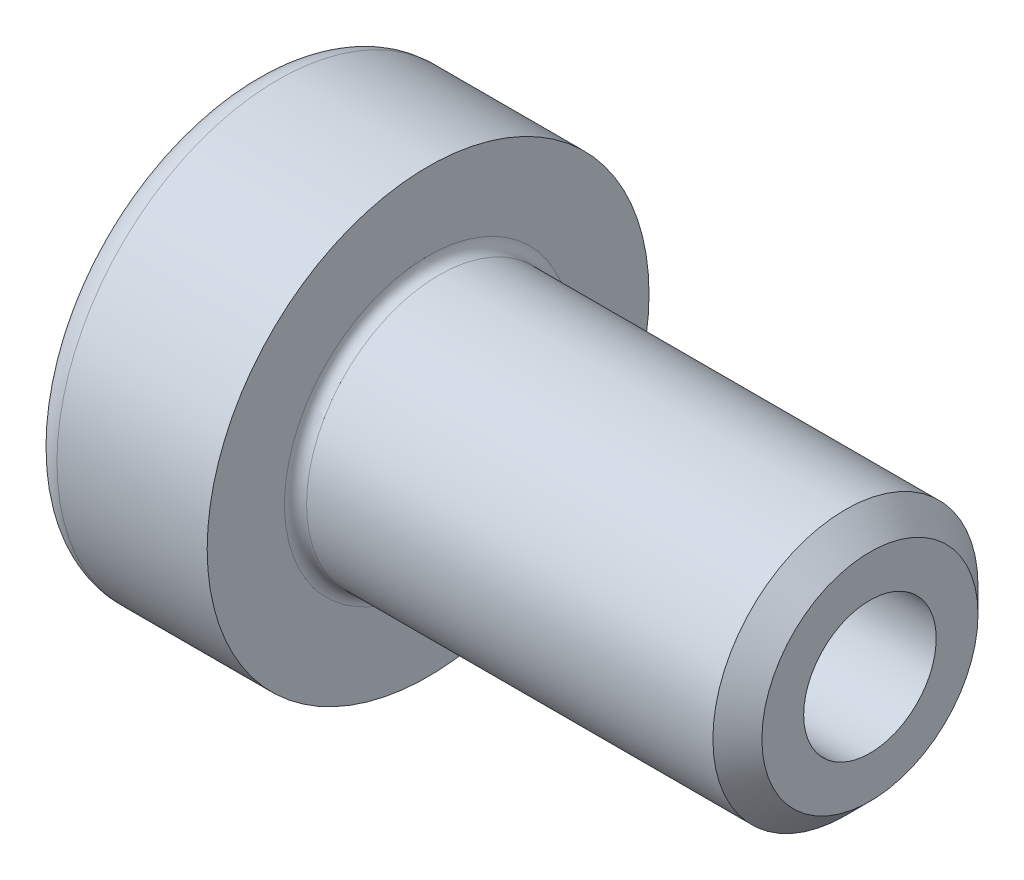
ISO-10303-21;
HEADER;
FILE_DESCRIPTION(('STEP AP214'),'2;1');
FILE_NAME('part.step','',(''),(''),'','','');
FILE_SCHEMA(('AUTOMOTIVE_DESIGN { 1 0 10303 214 1 1 1 1 }'));
ENDSEC;
DATA;
#1=APPLICATION_CONTEXT('core data for automotive mechanical design processes');
#2=APPLICATION_PROTOCOL_DEFINITION('international standard','automotive_design',2000,#1);
#3=PRODUCT_CONTEXT('',#1,'mechanical');
#4=PRODUCT('Part','Part','',(#3));
#5=PRODUCT_RELATED_PRODUCT_CATEGORY('part','',(#4));
#6=PRODUCT_DEFINITION_FORMATION('','',#4);
#7=PRODUCT_DEFINITION_CONTEXT('part definition',#1,'design');
#8=PRODUCT_DEFINITION('design','',#6,#7);
#9=PRODUCT_DEFINITION_SHAPE('','',#8);
#10=(LENGTH_UNIT() NAMED_UNIT(*) SI_UNIT(.MILLI.,.METRE.));
#11=(NAMED_UNIT(*) PLANE_ANGLE_UNIT() SI_UNIT($,.RADIAN.));
#12=(NAMED_UNIT(*) SI_UNIT($,.STERADIAN.) SOLID_ANGLE_UNIT());
#13=UNCERTAINTY_MEASURE_WITH_UNIT(LENGTH_MEASURE(1.E-05),#10,'distance_accuracy_value','');
#14=(GEOMETRIC_REPRESENTATION_CONTEXT(3) GLOBAL_UNCERTAINTY_ASSIGNED_CONTEXT((#13)) GLOBAL_UNIT_ASSIGNED_CONTEXT((#10,
#11,#12)) REPRESENTATION_CONTEXT('',''));
#15=CARTESIAN_POINT('',(0.,0.,0.));
#16=DIRECTION('',(0.,0.,1.));
#17=DIRECTION('',(1.,0.,0.));
#18=AXIS2_PLACEMENT_3D('',#15,#16,#17);
#19=CARTESIAN_POINT('',(2.5,1.44337567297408,2.49999999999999));
#20=DIRECTION('',(-1.,0.,0.));
#21=DIRECTION('',(0.,0.,1.));
#22=AXIS2_PLACEMENT_3D('',#19,#20,#21);
#23=PLANE('',#22);
#24=CARTESIAN_POINT('',(2.5,0.,0.));
#25=DIRECTION('',(-1.,0.,0.));
#26=DIRECTION('',(0.,0.,1.));
#27=AXIS2_PLACEMENT_3D('',#24,#25,#26);
#28=CIRCLE('',#27,2.5);
#29=CARTESIAN_POINT('',(2.5,0.,2.5));
#30=VERTEX_POINT('',#29);
#31=CARTESIAN_POINT('',(2.5,2.1650635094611,1.24999999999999));
#32=VERTEX_POINT('',#31);
#33=EDGE_CURVE('E107',#30,#32,#28,.T.);
#34=ORIENTED_EDGE('',*,*,#33,.F.);
#35=DIRECTION('',(0.,1.,0.));
#36=VECTOR('',#35,1.);
#37=CARTESIAN_POINT('',(2.5,-1.44337567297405,2.5));
#38=LINE('',#37,#36);
#39=CARTESIAN_POINT('',(2.5,1.44337567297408,2.49999999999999));
#40=VERTEX_POINT('',#39);
#41=EDGE_CURVE('E117',#30,#40,#38,.T.);
#42=ORIENTED_EDGE('',*,*,#41,.T.);
#43=DIRECTION('',(0.,-0.499999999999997,0.86602540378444));
#44=VECTOR('',#43,1.);
#45=CARTESIAN_POINT('',(2.5,2.88675134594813,0.));
#46=LINE('',#45,#44);
#47=EDGE_CURVE('E119',#32,#40,#46,.T.);
#48=ORIENTED_EDGE('',*,*,#47,.F.);
#49=EDGE_LOOP('',(#34,#42,#48));
#50=FACE_BOUND('',#49,.T.);
#51=ADVANCED_FACE('F37',(#50),#23,.T.);
#52=CARTESIAN_POINT('',(2.5,0.,0.));
#53=DIRECTION('',(-1.,0.,0.));
#54=DIRECTION('',(0.,0.,1.));
#55=AXIS2_PLACEMENT_3D('',#52,#53,#54);
#56=CIRCLE('',#55,2.5);
#57=CARTESIAN_POINT('',(2.5,2.1650635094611,-1.25));
#58=VERTEX_POINT('',#57);
#59=EDGE_CURVE('E11',#32,#58,#56,.T.);
#60=ORIENTED_EDGE('',*,*,#59,.F.);
#61=CARTESIAN_POINT('',(2.5,2.88675134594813,0.));
#62=VERTEX_POINT('',#61);
#63=EDGE_CURVE('E130',#62,#32,#46,.T.);
#64=ORIENTED_EDGE('',*,*,#63,.F.);
#65=DIRECTION('',(0.,-0.500000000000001,-0.866025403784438));
#66=VECTOR('',#65,1.);
#67=CARTESIAN_POINT('',(2.5,2.88675134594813,0.));
#68=LINE('',#67,#66);
#69=EDGE_CURVE('E148',#62,#58,#68,.T.);
#70=ORIENTED_EDGE('',*,*,#69,.T.);
#71=EDGE_LOOP('',(#60,#64,#70));
#72=FACE_BOUND('',#71,.T.);
#73=ADVANCED_FACE('F230',(#72),#23,.T.);
#74=CARTESIAN_POINT('',(2.5,0.,-2.5));
#75=VERTEX_POINT('',#74);
#76=EDGE_CURVE('E46',#58,#75,#56,.T.);
#77=ORIENTED_EDGE('',*,*,#76,.F.);
#78=CARTESIAN_POINT('',(2.5,1.44337567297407,-2.50000000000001));
#79=VERTEX_POINT('',#78);
#80=EDGE_CURVE('E147',#58,#79,#68,.T.);
#81=ORIENTED_EDGE('',*,*,#80,.T.);
#82=DIRECTION('',(0.,-1.,0.));
#83=VECTOR('',#82,1.);
#84=CARTESIAN_POINT('',(2.5,1.44337567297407,-2.50000000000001));
#85=LINE('',#84,#83);
#86=EDGE_CURVE('E144',#79,#75,#85,.T.);
#87=ORIENTED_EDGE('',*,*,#86,.T.);
#88=EDGE_LOOP('',(#77,#81,#87));
#89=FACE_BOUND('',#88,.T.);
#90=ADVANCED_FACE('F227',(#89),#23,.T.);
#91=CARTESIAN_POINT('',(2.5,-2.1650635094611,-1.24999999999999));
#92=VERTEX_POINT('',#91);
#93=EDGE_CURVE('E262',#75,#92,#56,.T.);
#94=ORIENTED_EDGE('',*,*,#93,.F.);
#95=CARTESIAN_POINT('',(2.5,-1.44337567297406,-2.5));
#96=VERTEX_POINT('',#95);
#97=EDGE_CURVE('E143',#75,#96,#85,.T.);
#98=ORIENTED_EDGE('',*,*,#97,.T.);
#99=DIRECTION('',(0.,0.499999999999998,-0.86602540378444));
#100=VECTOR('',#99,1.);
#101=CARTESIAN_POINT('',(2.5,-2.88675134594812,0.));
#102=LINE('',#101,#100);
#103=EDGE_CURVE('E139',#92,#96,#102,.T.);
#104=ORIENTED_EDGE('',*,*,#103,.F.);
#105=EDGE_LOOP('',(#94,#98,#104));
#106=FACE_BOUND('',#105,.T.);
#107=ADVANCED_FACE('F254',(#106),#23,.T.);
#108=CARTESIAN_POINT('',(2.5,-2.16506350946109,1.25));
#109=VERTEX_POINT('',#108);
#110=EDGE_CURVE('E53',#92,#109,#56,.T.);
#111=ORIENTED_EDGE('',*,*,#110,.F.);
#112=CARTESIAN_POINT('',(2.5,-2.88675134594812,0.));
#113=VERTEX_POINT('',#112);
#114=EDGE_CURVE('E140',#113,#92,#102,.T.);
#115=ORIENTED_EDGE('',*,*,#114,.F.);
#116=DIRECTION('',(0.,-0.500000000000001,-0.866025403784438));
#117=VECTOR('',#116,1.);
#118=CARTESIAN_POINT('',(2.5,-1.44337567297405,2.5));
#119=LINE('',#118,#117);
#120=EDGE_CURVE('E135',#109,#113,#119,.T.);
#121=ORIENTED_EDGE('',*,*,#120,.F.);
#122=EDGE_LOOP('',(#111,#115,#121));
#123=FACE_BOUND('',#122,.T.);
#124=ADVANCED_FACE('F209',(#123),#23,.T.);
#125=CARTESIAN_POINT('',(0.,0.,0.));
#126=DIRECTION('',(-1.,0.,0.));
#127=DIRECTION('',(0.,0.,1.));
#128=AXIS2_PLACEMENT_3D('',#125,#126,#127);
#129=PLANE('',#128);
#130=CARTESIAN_POINT('',(0.,0.,0.));
#131=DIRECTION('',(-1.,0.,0.));
#132=DIRECTION('',(0.,0.,1.));
#133=AXIS2_PLACEMENT_3D('',#130,#131,#132);
#134=CIRCLE('',#133,4.4);
#135=CARTESIAN_POINT('',(0.,0.,4.4));
#136=VERTEX_POINT('',#135);
#137=EDGE_CURVE('E192',#136,#136,#134,.T.);
#138=ORIENTED_EDGE('',*,*,#137,.T.);
#139=EDGE_LOOP('',(#138));
#140=FACE_BOUND('',#139,.T.);
#141=DIRECTION('',(0.,-0.500000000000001,-0.866025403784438));
#142=VECTOR('',#141,1.);
#143=CARTESIAN_POINT('',(0.,2.88675134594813,0.));
#144=LINE('',#143,#142);
#145=CARTESIAN_POINT('',(0.,2.88675134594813,0.));
#146=VERTEX_POINT('',#145);
#147=CARTESIAN_POINT('',(0.,1.44337567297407,-2.50000000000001));
#148=VERTEX_POINT('',#147);
#149=EDGE_CURVE('E162',#146,#148,#144,.T.);
#150=ORIENTED_EDGE('',*,*,#149,.F.);
#151=DIRECTION('',(0.,-0.499999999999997,0.86602540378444));
#152=VECTOR('',#151,1.);
#153=CARTESIAN_POINT('',(0.,2.88675134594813,0.));
#154=LINE('',#153,#152);
#155=CARTESIAN_POINT('',(0.,1.44337567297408,2.49999999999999));
#156=VERTEX_POINT('',#155);
#157=EDGE_CURVE('E61',#146,#156,#154,.T.);
#158=ORIENTED_EDGE('',*,*,#157,.T.);
#159=DIRECTION('',(0.,1.,0.));
#160=VECTOR('',#159,1.);
#161=CARTESIAN_POINT('',(0.,-1.44337567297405,2.5));
#162=LINE('',#161,#160);
#163=CARTESIAN_POINT('',(0.,-1.44337567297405,2.5));
#164=VERTEX_POINT('',#163);
#165=EDGE_CURVE('E153',#164,#156,#162,.T.);
#166=ORIENTED_EDGE('',*,*,#165,.F.);
#167=DIRECTION('',(0.,-0.500000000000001,-0.866025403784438));
#168=VECTOR('',#167,1.);
#169=CARTESIAN_POINT('',(0.,-1.44337567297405,2.5));
#170=LINE('',#169,#168);
#171=CARTESIAN_POINT('',(0.,-2.88675134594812,0.));
#172=VERTEX_POINT('',#171);
#173=EDGE_CURVE('E155',#164,#172,#170,.T.);
#174=ORIENTED_EDGE('',*,*,#173,.T.);
#175=DIRECTION('',(0.,0.499999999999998,-0.86602540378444));
#176=VECTOR('',#175,1.);
#177=CARTESIAN_POINT('',(0.,-2.88675134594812,0.));
#178=LINE('',#177,#176);
#179=CARTESIAN_POINT('',(0.,-1.44337567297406,-2.5));
#180=VERTEX_POINT('',#179);
#181=EDGE_CURVE('E157',#172,#180,#178,.T.);
#182=ORIENTED_EDGE('',*,*,#181,.T.);
#183=DIRECTION('',(0.,-1.,0.));
#184=VECTOR('',#183,1.);
#185=CARTESIAN_POINT('',(0.,1.44337567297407,-2.50000000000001));
#186=LINE('',#185,#184);
#187=EDGE_CURVE('E159',#148,#180,#186,.T.);
#188=ORIENTED_EDGE('',*,*,#187,.F.);
#189=EDGE_LOOP('',(#150,#158,#166,#174,#182,#188));
#190=FACE_BOUND('',#189,.T.);
#191=ADVANCED_FACE('F206',(#140,#190),#129,.T.);
#192=CARTESIAN_POINT('',(-31.75,0.,0.));
#193=DIRECTION('',(-1.,0.,0.));
#194=DIRECTION('',(0.,0.,1.));
#195=AXIS2_PLACEMENT_3D('',#192,#193,#194);
#196=CYLINDRICAL_SURFACE('',#195,5.);
#197=CARTESIAN_POINT('',(0.600000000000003,0.,0.));
#198=DIRECTION('',(-1.,0.,0.));
#199=DIRECTION('',(0.,0.,1.));
#200=AXIS2_PLACEMENT_3D('',#197,#198,#199);
#201=CIRCLE('',#200,5.);
#202=CARTESIAN_POINT('',(0.600000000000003,0.,5.));
#203=VERTEX_POINT('',#202);
#204=EDGE_CURVE('E113',#203,#203,#201,.F.);
#205=ORIENTED_EDGE('',*,*,#204,.T.);
#206=EDGE_LOOP('',(#205));
#207=FACE_BOUND('',#206,.T.);
#208=CARTESIAN_POINT('',(4.,0.,0.));
#209=DIRECTION('',(-1.,0.,0.));
#210=DIRECTION('',(0.,0.,1.));
#211=AXIS2_PLACEMENT_3D('',#208,#209,#210);
#212=CIRCLE('',#211,5.);
#213=CARTESIAN_POINT('',(4.,0.,5.));
#214=VERTEX_POINT('',#213);
#215=EDGE_CURVE('E183',#214,#214,#212,.T.);
#216=ORIENTED_EDGE('',*,*,#215,.T.);
#217=EDGE_LOOP('',(#216));
#218=FACE_BOUND('',#217,.T.);
#219=ADVANCED_FACE('F197',(#207,#218),#196,.T.);
#220=CARTESIAN_POINT('',(4.,5.,0.));
#221=DIRECTION('',(1.,0.,0.));
#222=DIRECTION('',(0.,0.,-1.));
#223=AXIS2_PLACEMENT_3D('',#220,#221,#222);
#224=PLANE('',#223);
#225=CARTESIAN_POINT('',(4.,0.,0.));
#226=DIRECTION('',(1.,0.,0.));
#227=DIRECTION('',(0.,0.,-1.));
#228=AXIS2_PLACEMENT_3D('',#225,#226,#227);
#229=CIRCLE('',#228,3.24999999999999);
#230=CARTESIAN_POINT('',(4.,0.,-3.24999999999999));
#231=VERTEX_POINT('',#230);
#232=EDGE_CURVE('E186',#231,#231,#229,.F.);
#233=ORIENTED_EDGE('',*,*,#232,.T.);
#234=EDGE_LOOP('',(#233));
#235=FACE_BOUND('',#234,.T.);
#236=ORIENTED_EDGE('',*,*,#215,.F.);
#237=EDGE_LOOP('',(#236));
#238=FACE_BOUND('',#237,.T.);
#239=ADVANCED_FACE('F342',(#235,#238),#224,.T.);
#240=CARTESIAN_POINT('',(-31.75,0.,0.));
#241=DIRECTION('',(-1.,0.,0.));
#242=DIRECTION('',(0.,0.,1.));
#243=AXIS2_PLACEMENT_3D('',#240,#241,#242);
#244=CYLINDRICAL_SURFACE('',#243,2.99999999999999);
#245=CARTESIAN_POINT('',(4.25,0.,0.));
#246=DIRECTION('',(1.,0.,0.));
#247=DIRECTION('',(0.,0.,-1.));
#248=AXIS2_PLACEMENT_3D('',#245,#246,#247);
#249=CIRCLE('',#248,2.99999999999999);
#250=CARTESIAN_POINT('',(4.25,0.,-2.99999999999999));
#251=VERTEX_POINT('',#250);
#252=EDGE_CURVE('E189',#251,#251,#249,.T.);
#253=ORIENTED_EDGE('',*,*,#252,.T.);
#254=EDGE_LOOP('',(#253));
#255=FACE_BOUND('',#254,.T.);
#256=CARTESIAN_POINT('',(13.4455,0.,0.));
#257=DIRECTION('',(-1.,0.,0.));
#258=DIRECTION('',(0.,0.,1.));
#259=AXIS2_PLACEMENT_3D('',#256,#257,#258);
#260=CIRCLE('',#259,2.99999999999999);
#261=CARTESIAN_POINT('',(13.4455,0.,2.99999999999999));
#262=VERTEX_POINT('',#261);
#263=EDGE_CURVE('E180',#262,#262,#260,.T.);
#264=ORIENTED_EDGE('',*,*,#263,.T.);
#265=EDGE_LOOP('',(#264));
#266=FACE_BOUND('',#265,.T.);
#267=ADVANCED_FACE('F335',(#255,#266),#244,.T.);
#268=CARTESIAN_POINT('',(14.,0.,0.));
#269=DIRECTION('',(-1.,0.,0.));
#270=DIRECTION('',(0.,0.,1.));
#271=AXIS2_PLACEMENT_3D('',#268,#269,#270);
#272=CONICAL_SURFACE('',#271,2.4455,0.785398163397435);
#273=ORIENTED_EDGE('',*,*,#263,.F.);
#274=EDGE_LOOP('',(#273));
#275=FACE_BOUND('',#274,.T.);
#276=CARTESIAN_POINT('',(14.,0.,0.));
#277=DIRECTION('',(-1.,0.,0.));
#278=DIRECTION('',(0.,0.,1.));
#279=AXIS2_PLACEMENT_3D('',#276,#277,#278);
#280=CIRCLE('',#279,2.4455);
#281=CARTESIAN_POINT('',(14.,0.,2.4455));
#282=VERTEX_POINT('',#281);
#283=EDGE_CURVE('E177',#282,#282,#280,.T.);
#284=ORIENTED_EDGE('',*,*,#283,.T.);
#285=EDGE_LOOP('',(#284));
#286=FACE_BOUND('',#285,.T.);
#287=ADVANCED_FACE('F309',(#275,#286),#272,.T.);
#288=CARTESIAN_POINT('',(14.,2.4455,0.));
#289=DIRECTION('',(1.,0.,0.));
#290=DIRECTION('',(0.,0.,-1.));
#291=AXIS2_PLACEMENT_3D('',#288,#289,#290);
#292=PLANE('',#291);
#293=CARTESIAN_POINT('',(14.,0.,0.));
#294=DIRECTION('',(-1.,0.,0.));
#295=DIRECTION('',(0.,0.,1.));
#296=AXIS2_PLACEMENT_3D('',#293,#294,#295);
#297=CIRCLE('',#296,1.5);
#298=CARTESIAN_POINT('',(14.,0.,1.5));
#299=VERTEX_POINT('',#298);
#300=EDGE_CURVE('E329',#299,#299,#297,.T.);
#301=ORIENTED_EDGE('',*,*,#300,.T.);
#302=EDGE_LOOP('',(#301));
#303=FACE_BOUND('',#302,.T.);
#304=ORIENTED_EDGE('',*,*,#283,.F.);
#305=EDGE_LOOP('',(#304));
#306=FACE_BOUND('',#305,.T.);
#307=ADVANCED_FACE('F305',(#303,#306),#292,.T.);
#308=CARTESIAN_POINT('',(4.25,0.,0.));
#309=DIRECTION('',(1.,0.,0.));
#310=DIRECTION('',(0.,0.,-1.));
#311=AXIS2_PLACEMENT_3D('',#308,#309,#310);
#312=TOROIDAL_SURFACE('',#311,3.24999999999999,0.25);
#313=ORIENTED_EDGE('',*,*,#252,.F.);
#314=EDGE_LOOP('',(#313));
#315=FACE_BOUND('',#314,.T.);
#316=ORIENTED_EDGE('',*,*,#232,.F.);
#317=EDGE_LOOP('',(#316));
#318=FACE_BOUND('',#317,.T.);
#319=ADVANCED_FACE('F203',(#315,#318),#312,.F.);
#320=CARTESIAN_POINT('',(0.600000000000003,0.,0.));
#321=DIRECTION('',(-1.,0.,0.));
#322=DIRECTION('',(0.,0.,1.));
#323=AXIS2_PLACEMENT_3D('',#320,#321,#322);
#324=TOROIDAL_SURFACE('',#323,4.4,0.6);
#325=ORIENTED_EDGE('',*,*,#204,.F.);
#326=EDGE_LOOP('',(#325));
#327=FACE_BOUND('',#326,.T.);
#328=ORIENTED_EDGE('',*,*,#137,.F.);
#329=EDGE_LOOP('',(#328));
#330=FACE_BOUND('',#329,.T.);
#331=ADVANCED_FACE('F39',(#327,#330),#324,.T.);
#332=CARTESIAN_POINT('',(2.5,2.88675134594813,0.));
#333=DIRECTION('',(0.,-0.86602540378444,-0.499999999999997));
#334=DIRECTION('',(0.,0.499999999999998,-0.86602540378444));
#335=AXIS2_PLACEMENT_3D('',#332,#333,#334);
#336=PLANE('',#335);
#337=DIRECTION('',(-1.,0.,0.));
#338=VECTOR('',#337,1.);
#339=CARTESIAN_POINT('',(2.5,1.44337567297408,2.49999999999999));
#340=LINE('',#339,#338);
#341=EDGE_CURVE('E129',#40,#156,#340,.T.);
#342=ORIENTED_EDGE('',*,*,#341,.T.);
#343=ORIENTED_EDGE('',*,*,#157,.F.);
#344=DIRECTION('',(-1.,0.,0.));
#345=VECTOR('',#344,1.);
#346=CARTESIAN_POINT('',(2.5,2.88675134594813,0.));
#347=LINE('',#346,#345);
#348=EDGE_CURVE('E151',#62,#146,#347,.T.);
#349=ORIENTED_EDGE('',*,*,#348,.F.);
#350=ORIENTED_EDGE('',*,*,#63,.T.);
#351=ORIENTED_EDGE('',*,*,#47,.T.);
#352=EDGE_LOOP('',(#342,#343,#349,#350,#351));
#353=FACE_BOUND('',#352,.T.);
#354=ADVANCED_FACE('F202',(#353),#336,.T.);
#355=CARTESIAN_POINT('',(2.5,-1.44337567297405,2.5));
#356=DIRECTION('',(0.,0.,1.));
#357=DIRECTION('',(0.,-1.,0.));
#358=AXIS2_PLACEMENT_3D('',#355,#356,#357);
#359=PLANE('',#358);
#360=ORIENTED_EDGE('',*,*,#41,.F.);
#361=CARTESIAN_POINT('',(2.5,-1.44337567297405,2.5));
#362=VERTEX_POINT('',#361);
#363=EDGE_CURVE('E127',#362,#30,#38,.T.);
#364=ORIENTED_EDGE('',*,*,#363,.F.);
#365=DIRECTION('',(-1.,0.,0.));
#366=VECTOR('',#365,1.);
#367=CARTESIAN_POINT('',(2.5,-1.44337567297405,2.5));
#368=LINE('',#367,#366);
#369=EDGE_CURVE('E174',#362,#164,#368,.T.);
#370=ORIENTED_EDGE('',*,*,#369,.T.);
#371=ORIENTED_EDGE('',*,*,#165,.T.);
#372=ORIENTED_EDGE('',*,*,#341,.F.);
#373=EDGE_LOOP('',(#360,#364,#370,#371,#372));
#374=FACE_BOUND('',#373,.T.);
#375=ADVANCED_FACE('F126',(#374),#359,.F.);
#376=CARTESIAN_POINT('',(2.5,-1.44337567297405,2.5));
#377=DIRECTION('',(0.,0.866025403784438,-0.500000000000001));
#378=DIRECTION('',(0.,0.500000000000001,0.866025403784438));
#379=AXIS2_PLACEMENT_3D('',#376,#377,#378);
#380=PLANE('',#379);
#381=DIRECTION('',(-1.,0.,0.));
#382=VECTOR('',#381,1.);
#383=CARTESIAN_POINT('',(2.5,-2.88675134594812,0.));
#384=LINE('',#383,#382);
#385=EDGE_CURVE('E171',#113,#172,#384,.T.);
#386=ORIENTED_EDGE('',*,*,#385,.T.);
#387=ORIENTED_EDGE('',*,*,#173,.F.);
#388=ORIENTED_EDGE('',*,*,#369,.F.);
#389=EDGE_CURVE('E134',#362,#109,#119,.T.);
#390=ORIENTED_EDGE('',*,*,#389,.T.);
#391=ORIENTED_EDGE('',*,*,#120,.T.);
#392=EDGE_LOOP('',(#386,#387,#388,#390,#391));
#393=FACE_BOUND('',#392,.T.);
#394=ADVANCED_FACE('F236',(#393),#380,.T.);
#395=CARTESIAN_POINT('',(2.5,-2.88675134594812,0.));
#396=DIRECTION('',(0.,0.86602540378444,0.499999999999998));
#397=DIRECTION('',(0.,-0.499999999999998,0.86602540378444));
#398=AXIS2_PLACEMENT_3D('',#395,#396,#397);
#399=PLANE('',#398);
#400=DIRECTION('',(-1.,0.,0.));
#401=VECTOR('',#400,1.);
#402=CARTESIAN_POINT('',(2.5,-1.44337567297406,-2.5));
#403=LINE('',#402,#401);
#404=EDGE_CURVE('E168',#96,#180,#403,.T.);
#405=ORIENTED_EDGE('',*,*,#404,.T.);
#406=ORIENTED_EDGE('',*,*,#181,.F.);
#407=ORIENTED_EDGE('',*,*,#385,.F.);
#408=ORIENTED_EDGE('',*,*,#114,.T.);
#409=ORIENTED_EDGE('',*,*,#103,.T.);
#410=EDGE_LOOP('',(#405,#406,#407,#408,#409));
#411=FACE_BOUND('',#410,.T.);
#412=ADVANCED_FACE('F266',(#411),#399,.T.);
#413=CARTESIAN_POINT('',(2.5,1.44337567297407,-2.50000000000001));
#414=DIRECTION('',(0.,0.,-1.));
#415=DIRECTION('',(0.,1.,0.));
#416=AXIS2_PLACEMENT_3D('',#413,#414,#415);
#417=PLANE('',#416);
#418=ORIENTED_EDGE('',*,*,#97,.F.);
#419=ORIENTED_EDGE('',*,*,#86,.F.);
#420=DIRECTION('',(-1.,0.,0.));
#421=VECTOR('',#420,1.);
#422=CARTESIAN_POINT('',(2.5,1.44337567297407,-2.50000000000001));
#423=LINE('',#422,#421);
#424=EDGE_CURVE('E165',#79,#148,#423,.T.);
#425=ORIENTED_EDGE('',*,*,#424,.T.);
#426=ORIENTED_EDGE('',*,*,#187,.T.);
#427=ORIENTED_EDGE('',*,*,#404,.F.);
#428=EDGE_LOOP('',(#418,#419,#425,#426,#427));
#429=FACE_BOUND('',#428,.T.);
#430=ADVANCED_FACE('F222',(#429),#417,.F.);
#431=CARTESIAN_POINT('',(2.5,2.88675134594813,0.));
#432=DIRECTION('',(0.,0.866025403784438,-0.500000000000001));
#433=DIRECTION('',(0.,0.500000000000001,0.866025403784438));
#434=AXIS2_PLACEMENT_3D('',#431,#432,#433);
#435=PLANE('',#434);
#436=ORIENTED_EDGE('',*,*,#80,.F.);
#437=ORIENTED_EDGE('',*,*,#69,.F.);
#438=ORIENTED_EDGE('',*,*,#348,.T.);
#439=ORIENTED_EDGE('',*,*,#149,.T.);
#440=ORIENTED_EDGE('',*,*,#424,.F.);
#441=EDGE_LOOP('',(#436,#437,#438,#439,#440));
#442=FACE_BOUND('',#441,.T.);
#443=ADVANCED_FACE('F217',(#442),#435,.F.);
#444=EDGE_CURVE('E41',#109,#30,#56,.T.);
#445=ORIENTED_EDGE('',*,*,#444,.F.);
#446=ORIENTED_EDGE('',*,*,#389,.F.);
#447=ORIENTED_EDGE('',*,*,#363,.T.);
#448=EDGE_LOOP('',(#445,#446,#447));
#449=FACE_BOUND('',#448,.T.);
#450=ADVANCED_FACE('F132',(#449),#23,.T.);
#451=CARTESIAN_POINT('',(2.5,0.,0.));
#452=DIRECTION('',(-1.,0.,0.));
#453=DIRECTION('',(0.,0.,1.));
#454=AXIS2_PLACEMENT_3D('',#451,#452,#453);
#455=CONICAL_SURFACE('',#454,2.5,1.04719755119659);
#456=CARTESIAN_POINT('',(3.07735026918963,0.,0.));
#457=DIRECTION('',(-1.,0.,0.));
#458=DIRECTION('',(0.,0.,1.));
#459=AXIS2_PLACEMENT_3D('',#456,#457,#458);
#460=CIRCLE('',#459,1.5);
#461=CARTESIAN_POINT('',(3.07735026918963,0.,1.5));
#462=VERTEX_POINT('',#461);
#463=EDGE_CURVE('E121',#462,#462,#460,.T.);
#464=ORIENTED_EDGE('',*,*,#463,.F.);
#465=EDGE_LOOP('',(#464));
#466=FACE_BOUND('',#465,.T.);
#467=ORIENTED_EDGE('',*,*,#33,.T.);
#468=ORIENTED_EDGE('',*,*,#59,.T.);
#469=ORIENTED_EDGE('',*,*,#76,.T.);
#470=ORIENTED_EDGE('',*,*,#93,.T.);
#471=ORIENTED_EDGE('',*,*,#110,.T.);
#472=ORIENTED_EDGE('',*,*,#444,.T.);
#473=EDGE_LOOP('',(#467,#468,#469,#470,#471,#472));
#474=FACE_BOUND('',#473,.T.);
#475=ADVANCED_FACE('F106',(#466,#474),#455,.F.);
#476=CARTESIAN_POINT('',(0.,0.,0.));
#477=DIRECTION('',(-1.,0.,0.));
#478=DIRECTION('',(0.,0.,1.));
#479=AXIS2_PLACEMENT_3D('',#476,#477,#478);
#480=CYLINDRICAL_SURFACE('',#479,1.5);
#481=ORIENTED_EDGE('',*,*,#463,.T.);
#482=EDGE_LOOP('',(#481));
#483=FACE_BOUND('',#482,.T.);
#484=ORIENTED_EDGE('',*,*,#300,.F.);
#485=EDGE_LOOP('',(#484));
#486=FACE_BOUND('',#485,.T.);
#487=ADVANCED_FACE('F251',(#483,#486),#480,.F.);
#488=CLOSED_SHELL('',(#51,#73,#90,#107,#124,#191,#219,#239,#267,#287,#307,#319,#331,#354,#375,
#394,#412,#430,#443,#450,#475,#487));
#489=MANIFOLD_SOLID_BREP('B2',#488);
#490=ADVANCED_BREP_SHAPE_REPRESENTATION('',(#18,#489),#14);
#491=SHAPE_DEFINITION_REPRESENTATION(#9,#490);
ENDSEC;
END-ISO-10303-21;
